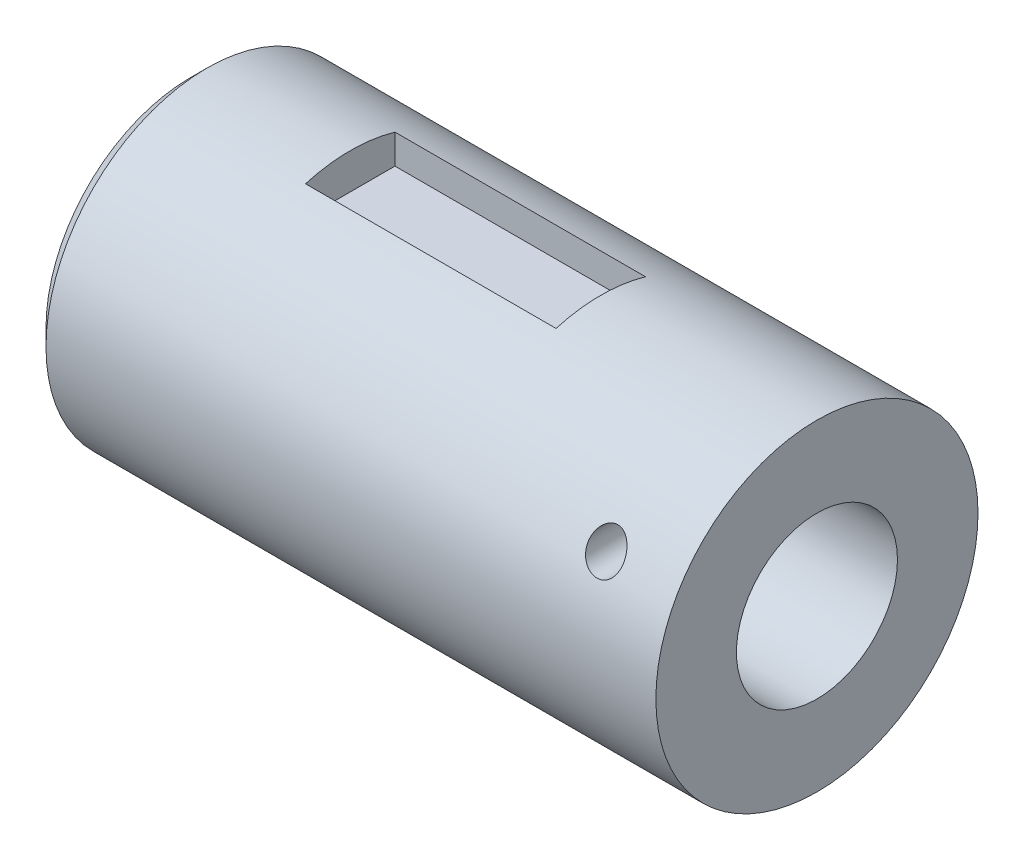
ISO-10303-21;
HEADER;
FILE_DESCRIPTION(('STEP AP214'),'2;1');
FILE_NAME('part.step','',(''),(''),'','','');
FILE_SCHEMA(('AUTOMOTIVE_DESIGN { 1 0 10303 214 1 1 1 1 }'));
ENDSEC;
DATA;
#1=APPLICATION_CONTEXT('core data for automotive mechanical design processes');
#2=APPLICATION_PROTOCOL_DEFINITION('international standard','automotive_design',2000,#1);
#3=PRODUCT_CONTEXT('',#1,'mechanical');
#4=PRODUCT('Part','Part','',(#3));
#5=PRODUCT_RELATED_PRODUCT_CATEGORY('part','',(#4));
#6=PRODUCT_DEFINITION_FORMATION('','',#4);
#7=PRODUCT_DEFINITION_CONTEXT('part definition',#1,'design');
#8=PRODUCT_DEFINITION('design','',#6,#7);
#9=PRODUCT_DEFINITION_SHAPE('','',#8);
#10=(LENGTH_UNIT() NAMED_UNIT(*) SI_UNIT(.MILLI.,.METRE.));
#11=(NAMED_UNIT(*) PLANE_ANGLE_UNIT() SI_UNIT($,.RADIAN.));
#12=(NAMED_UNIT(*) SI_UNIT($,.STERADIAN.) SOLID_ANGLE_UNIT());
#13=UNCERTAINTY_MEASURE_WITH_UNIT(LENGTH_MEASURE(1.E-05),#10,'distance_accuracy_value','');
#14=(GEOMETRIC_REPRESENTATION_CONTEXT(3) GLOBAL_UNCERTAINTY_ASSIGNED_CONTEXT((#13)) GLOBAL_UNIT_ASSIGNED_CONTEXT((#10,
#11,#12)) REPRESENTATION_CONTEXT('',''));
#15=CARTESIAN_POINT('',(0.,0.,0.));
#16=DIRECTION('',(0.,0.,1.));
#17=DIRECTION('',(1.,0.,0.));
#18=AXIS2_PLACEMENT_3D('',#15,#16,#17);
#19=CARTESIAN_POINT('',(38.6818850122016,0.,0.));
#20=DIRECTION('',(1.,0.,0.));
#21=DIRECTION('',(0.,0.,-1.));
#22=AXIS2_PLACEMENT_3D('',#19,#20,#21);
#23=CYLINDRICAL_SURFACE('',#22,18.);
#24=CARTESIAN_POINT('',(-41.5619397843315,0.,0.));
#25=DIRECTION('',(-1.,0.,0.));
#26=DIRECTION('',(0.,0.,1.));
#27=AXIS2_PLACEMENT_3D('',#24,#25,#26);
#28=CIRCLE('',#27,18.);
#29=CARTESIAN_POINT('',(-41.5619397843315,17.2916164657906,-5.));
#30=VERTEX_POINT('',#29);
#31=CARTESIAN_POINT('',(-41.5619397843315,17.2916164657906,5.));
#32=VERTEX_POINT('',#31);
#33=EDGE_CURVE('E161',#30,#32,#28,.F.);
#34=ORIENTED_EDGE('',*,*,#33,.F.);
#35=DIRECTION('',(1.,0.,0.));
#36=VECTOR('',#35,1.);
#37=CARTESIAN_POINT('',(38.6818850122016,17.2916164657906,-5.));
#38=LINE('',#37,#36);
#39=CARTESIAN_POINT('',(-13.5619397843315,17.2916164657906,-5.));
#40=VERTEX_POINT('',#39);
#41=EDGE_CURVE('E11',#40,#30,#38,.F.);
#42=ORIENTED_EDGE('',*,*,#41,.F.);
#43=CARTESIAN_POINT('',(-13.5619397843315,0.,0.));
#44=DIRECTION('',(1.,0.,0.));
#45=DIRECTION('',(0.,0.,-1.));
#46=AXIS2_PLACEMENT_3D('',#43,#44,#45);
#47=CIRCLE('',#46,18.);
#48=CARTESIAN_POINT('',(-13.5619397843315,17.2916164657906,5.));
#49=VERTEX_POINT('',#48);
#50=EDGE_CURVE('E52',#49,#40,#47,.F.);
#51=ORIENTED_EDGE('',*,*,#50,.F.);
#52=DIRECTION('',(1.,0.,0.));
#53=VECTOR('',#52,1.);
#54=CARTESIAN_POINT('',(38.6818850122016,17.2916164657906,5.));
#55=LINE('',#54,#53);
#56=EDGE_CURVE('E242',#32,#49,#55,.T.);
#57=ORIENTED_EDGE('',*,*,#56,.F.);
#58=EDGE_LOOP('',(#34,#42,#51,#57));
#59=FACE_BOUND('',#58,.T.);
#60=CARTESIAN_POINT('',(0.597924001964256,9.00000000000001,-15.5884572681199));
#61=CARTESIAN_POINT('',(0.597925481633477,8.87955349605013,-15.6579969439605));
#62=CARTESIAN_POINT('',(0.608807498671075,8.7582786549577,-15.7261381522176));
#63=CARTESIAN_POINT('',(0.653174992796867,8.51735808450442,-15.8579143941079));
#64=CARTESIAN_POINT('',(0.686658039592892,8.39771218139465,-15.921549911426));
#65=CARTESIAN_POINT('',(0.776949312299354,8.16340628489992,-16.0429515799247));
#66=CARTESIAN_POINT('',(0.833877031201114,8.04877521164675,-16.1006857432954));
#67=CARTESIAN_POINT('',(0.970769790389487,7.82996229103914,-16.2082247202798));
#68=CARTESIAN_POINT('',(1.05072141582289,7.72577440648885,-16.2580341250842));
#69=CARTESIAN_POINT('',(1.22279599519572,7.54289576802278,-16.3436194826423));
#70=CARTESIAN_POINT('',(1.31285237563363,7.46268928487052,-16.3803077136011));
#71=CARTESIAN_POINT('',(1.50796153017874,7.31873757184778,-16.4451308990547));
#72=CARTESIAN_POINT('',(1.61300313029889,7.25498017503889,-16.4732721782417));
#73=CARTESIAN_POINT('',(1.8231357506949,7.15286396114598,-16.517848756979));
#74=CARTESIAN_POINT('',(1.92708919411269,7.1125553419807,-16.5351961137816));
#75=CARTESIAN_POINT('',(2.14117882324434,7.04966360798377,-16.5621082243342));
#76=CARTESIAN_POINT('',(2.25131236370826,7.02707297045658,-16.5716762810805));
#77=CARTESIAN_POINT('',(2.46740447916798,7.00148005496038,-16.5825044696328));
#78=CARTESIAN_POINT('',(2.57321006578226,6.99737085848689,-16.5842341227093));
#79=CARTESIAN_POINT('',(2.78401487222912,7.00588578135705,-16.5806389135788));
#80=CARTESIAN_POINT('',(2.88901422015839,7.01850718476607,-16.5753151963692));
#81=CARTESIAN_POINT('',(3.09341897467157,7.05959446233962,-16.557856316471));
#82=CARTESIAN_POINT('',(3.19288856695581,7.08779182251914,-16.5458365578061));
#83=CARTESIAN_POINT('',(3.38542859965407,7.15870594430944,-16.5152780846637));
#84=CARTESIAN_POINT('',(3.47849878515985,7.20142328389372,-16.4967391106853));
#85=CARTESIAN_POINT('',(3.65793380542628,7.30084365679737,-16.4529840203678));
#86=CARTESIAN_POINT('',(3.74410380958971,7.35783623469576,-16.4276287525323));
#87=CARTESIAN_POINT('',(3.90548216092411,7.48318133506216,-16.3709108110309));
#88=CARTESIAN_POINT('',(3.98068830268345,7.55153613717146,-16.3395469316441));
#89=CARTESIAN_POINT('',(4.12288936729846,7.70162147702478,-16.2693660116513));
#90=CARTESIAN_POINT('',(4.18913779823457,7.78390331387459,-16.230218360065));
#91=CARTESIAN_POINT('',(4.3069460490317,7.9559101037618,-16.146598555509));
#92=CARTESIAN_POINT('',(4.35850084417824,8.04563758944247,-16.1021245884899));
#93=CARTESIAN_POINT('',(4.45063676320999,8.23848757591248,-16.0043756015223));
#94=CARTESIAN_POINT('',(4.48976724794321,8.34208224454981,-15.95066717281));
#95=CARTESIAN_POINT('',(4.55020069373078,8.55214114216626,-15.8390358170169));
#96=CARTESIAN_POINT('',(4.57149562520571,8.65860664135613,-15.781111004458));
#97=CARTESIAN_POINT('',(4.59810640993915,8.88376767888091,-15.6555758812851));
#98=CARTESIAN_POINT('',(4.60137812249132,9.00250452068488,-15.5876054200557));
#99=CARTESIAN_POINT('',(4.58726459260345,9.23747549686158,-15.4495195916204));
#100=CARTESIAN_POINT('',(4.56987031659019,9.3537085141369,-15.3794032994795));
#101=CARTESIAN_POINT('',(4.51262185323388,9.59186974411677,-15.232117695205));
#102=CARTESIAN_POINT('',(4.47080860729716,9.71330498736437,-15.1549054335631));
#103=CARTESIAN_POINT('',(4.36411002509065,9.9471663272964,-15.0024463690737));
#104=CARTESIAN_POINT('',(4.29920126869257,10.0595831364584,-14.9272016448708));
#105=CARTESIAN_POINT('',(4.14598893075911,10.2731787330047,-14.7810261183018));
#106=CARTESIAN_POINT('',(4.05742215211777,10.3742116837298,-14.7101556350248));
#107=CARTESIAN_POINT('',(3.85799313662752,10.5590380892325,-14.5780511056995));
#108=CARTESIAN_POINT('',(3.74718990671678,10.6428760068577,-14.5167923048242));
#109=CARTESIAN_POINT('',(3.54563729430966,10.7637159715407,-14.427268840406));
#110=CARTESIAN_POINT('',(3.46049776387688,10.8070175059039,-14.3948101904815));
#111=CARTESIAN_POINT('',(3.28247078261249,10.8816703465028,-14.3384600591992));
#112=CARTESIAN_POINT('',(3.18959054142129,10.9130326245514,-14.3145607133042));
#113=CARTESIAN_POINT('',(2.9975978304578,10.962176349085,-14.2769630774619));
#114=CARTESIAN_POINT('',(2.89844894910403,10.9798686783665,-14.2633317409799));
#115=CARTESIAN_POINT('',(2.69770861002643,11.0000499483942,-14.2477744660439));
#116=CARTESIAN_POINT('',(2.59611830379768,11.0025459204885,-14.2458431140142));
#117=CARTESIAN_POINT('',(2.40475962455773,10.9927128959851,-14.2534304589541));
#118=CARTESIAN_POINT('',(2.31485997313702,10.9818977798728,-14.2617799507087));
#119=CARTESIAN_POINT('',(2.13857629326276,10.9486015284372,-14.2873566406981));
#120=CARTESIAN_POINT('',(2.05219265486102,10.9261191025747,-14.3045848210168));
#121=CARTESIAN_POINT('',(1.88339584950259,10.8701618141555,-14.3471540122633));
#122=CARTESIAN_POINT('',(1.80108280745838,10.8364954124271,-14.3726361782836));
#123=CARTESIAN_POINT('',(1.64347828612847,10.7597518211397,-14.4301780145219));
#124=CARTESIAN_POINT('',(1.56818950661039,10.7166710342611,-14.462240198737));
#125=CARTESIAN_POINT('',(1.41473349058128,10.6154644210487,-14.5367265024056));
#126=CARTESIAN_POINT('',(1.33782275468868,10.556051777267,-14.5799832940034));
#127=CARTESIAN_POINT('',(1.19492777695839,10.4285607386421,-14.6714446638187));
#128=CARTESIAN_POINT('',(1.12895062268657,10.3604767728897,-14.7196524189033));
#129=CARTESIAN_POINT('',(0.996340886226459,10.2031184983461,-14.8292703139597));
#130=CARTESIAN_POINT('',(0.932130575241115,10.1123099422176,-14.8914125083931));
#131=CARTESIAN_POINT('',(0.820112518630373,9.92277856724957,-15.0183723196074));
#132=CARTESIAN_POINT('',(0.772315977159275,9.8240503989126,-15.0831917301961));
#133=CARTESIAN_POINT('',(0.6885060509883,9.60765237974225,-15.2220744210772));
#134=CARTESIAN_POINT('',(0.654773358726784,9.4891727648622,-15.296262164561));
#135=CARTESIAN_POINT('',(0.609481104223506,9.24742225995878,-15.4436143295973));
#136=CARTESIAN_POINT('',(0.59792247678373,9.12415116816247,-15.5167787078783));
#137=CARTESIAN_POINT('',(0.597924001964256,9.00000000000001,-15.5884572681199));
#138=B_SPLINE_CURVE_WITH_KNOTS('',3,(#60,#61,#62,#63,#64,#65,#66,#67,#68,#69,#70,#71,#72,#73,
#74,#75,#76,#77,#78,#79,#80,#81,#82,#83,#84,#85,#86,#87,#88,#89,#90,#91,#92,#93,#94,#95,#96,#97,
#98,#99,#100,#101,#102,#103,#104,#105,#106,#107,#108,#109,#110,#111,#112,#113,#114,#115,#116,
#117,#118,#119,#120,#121,#122,#123,#124,#125,#126,#127,#128,#129,#130,#131,#132,#133,#134,#135,
#136,#137),.UNSPECIFIED.,.T.,.F.,(4,2,2,2,2,2,2,2,2,2,2,2,2,2,2,2,2,2,2,2,2,2,2,2,2,2,2,2,2,2,2,
2,2,2,2,2,2,2,4),(0.,0.416791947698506,0.833539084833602,1.25243711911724,1.67109157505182,
2.04714210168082,2.42291367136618,2.75966841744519,3.09628010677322,3.41243668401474,
3.72854194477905,4.03936064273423,4.35019171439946,4.66792619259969,4.98572449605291,
5.32227731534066,5.65894508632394,6.02666361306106,6.39454759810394,6.80341034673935,
7.21245188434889,7.65997578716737,8.10795480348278,8.56114165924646,9.01314146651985,
9.31461756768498,9.61581594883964,9.91896171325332,10.2219672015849,10.4934796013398,
10.7650220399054,11.0414778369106,11.3180394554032,11.6360048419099,11.9541755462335,
12.3349112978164,12.71590642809,13.1454998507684,13.5751113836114),.UNSPECIFIED.);
#139=CARTESIAN_POINT('',(0.597924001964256,9.00000000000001,-15.5884572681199));
#140=VERTEX_POINT('',#139);
#141=EDGE_CURVE('E122',#140,#140,#138,.T.);
#142=ORIENTED_EDGE('',*,*,#141,.T.);
#143=EDGE_LOOP('',(#142));
#144=FACE_BOUND('',#143,.T.);
#145=CARTESIAN_POINT('',(-57.5619397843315,0.,0.));
#146=DIRECTION('',(1.,0.,0.));
#147=DIRECTION('',(0.,0.,-1.));
#148=AXIS2_PLACEMENT_3D('',#145,#146,#147);
#149=CIRCLE('',#148,18.);
#150=CARTESIAN_POINT('',(-57.5619397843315,0.,-18.));
#151=VERTEX_POINT('',#150);
#152=EDGE_CURVE('E193',#151,#151,#149,.T.);
#153=ORIENTED_EDGE('',*,*,#152,.T.);
#154=EDGE_LOOP('',(#153));
#155=FACE_BOUND('',#154,.T.);
#156=CARTESIAN_POINT('',(10.5979240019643,0.,0.));
#157=DIRECTION('',(1.,0.,0.));
#158=DIRECTION('',(0.,0.,-1.));
#159=AXIS2_PLACEMENT_3D('',#156,#157,#158);
#160=CIRCLE('',#159,18.);
#161=CARTESIAN_POINT('',(10.5979240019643,0.,-18.));
#162=VERTEX_POINT('',#161);
#163=EDGE_CURVE('E196',#162,#162,#160,.T.);
#164=ORIENTED_EDGE('',*,*,#163,.F.);
#165=EDGE_LOOP('',(#164));
#166=FACE_BOUND('',#165,.T.);
#167=CARTESIAN_POINT('',(0.597924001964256,9.00000000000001,15.5884572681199));
#168=CARTESIAN_POINT('',(0.597927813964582,9.14766556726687,15.5031975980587));
#169=CARTESIAN_POINT('',(0.614289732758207,9.29421282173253,15.415759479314));
#170=CARTESIAN_POINT('',(0.678243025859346,9.57993263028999,15.2398539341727));
#171=CARTESIAN_POINT('',(0.725887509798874,9.71909220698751,15.1513850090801));
#172=CARTESIAN_POINT('',(0.844383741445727,9.97071436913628,14.9868266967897));
#173=CARTESIAN_POINT('',(0.912153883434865,10.0844350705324,14.9104361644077));
#174=CARTESIAN_POINT('',(1.07094302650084,10.2984687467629,14.7634114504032));
#175=CARTESIAN_POINT('',(1.16191511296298,10.3988081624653,14.6927660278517));
#176=CARTESIAN_POINT('',(1.33966190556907,10.5579077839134,14.5786683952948));
#177=CARTESIAN_POINT('',(1.4213756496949,10.6206950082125,14.5329221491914));
#178=CARTESIAN_POINT('',(1.59634793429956,10.7342675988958,14.4492373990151));
#179=CARTESIAN_POINT('',(1.68959164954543,10.7850681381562,14.411289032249));
#180=CARTESIAN_POINT('',(1.87122512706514,10.8655391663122,14.3506869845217));
#181=CARTESIAN_POINT('',(1.95822954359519,10.8972400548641,14.3265903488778));
#182=CARTESIAN_POINT('',(2.13768885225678,10.9485569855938,14.2874123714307));
#183=CARTESIAN_POINT('',(2.23014065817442,10.968179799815,14.2723259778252));
#184=CARTESIAN_POINT('',(2.41837010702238,10.9941960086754,14.252295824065));
#185=CARTESIAN_POINT('',(2.51415934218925,11.0005373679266,14.2473919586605));
#186=CARTESIAN_POINT('',(2.70560300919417,10.9993911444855,14.2482769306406));
#187=CARTESIAN_POINT('',(2.80125745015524,10.9919045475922,14.2540650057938));
#188=CARTESIAN_POINT('',(2.98318942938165,10.9645570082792,14.2751095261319));
#189=CARTESIAN_POINT('',(3.06967170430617,10.9455347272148,14.2897240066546));
#190=CARTESIAN_POINT('',(3.23779808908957,10.896899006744,14.326846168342));
#191=CARTESIAN_POINT('',(3.31944114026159,10.8672832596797,14.3493555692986));
#192=CARTESIAN_POINT('',(3.48217742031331,10.7962588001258,14.4028783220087));
#193=CARTESIAN_POINT('',(3.5627962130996,10.7541474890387,14.4343921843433));
#194=CARTESIAN_POINT('',(3.71576345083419,10.6608652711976,14.5034243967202));
#195=CARTESIAN_POINT('',(3.78810775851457,10.6096898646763,14.5409457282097));
#196=CARTESIAN_POINT('',(3.93594654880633,10.4900535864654,14.6275469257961));
#197=CARTESIAN_POINT('',(4.00974920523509,10.4201358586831,14.6774984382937));
#198=CARTESIAN_POINT('',(4.14471000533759,10.2718187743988,14.7816769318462));
#199=CARTESIAN_POINT('',(4.20585962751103,10.1934137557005,14.8359067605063));
#200=CARTESIAN_POINT('',(4.32575633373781,10.0140749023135,14.9576789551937));
#201=CARTESIAN_POINT('',(4.38179516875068,9.91170373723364,15.0257803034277));
#202=CARTESIAN_POINT('',(4.47512518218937,9.69967743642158,15.1635179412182));
#203=CARTESIAN_POINT('',(4.51240424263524,9.59001764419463,15.2331551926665));
#204=CARTESIAN_POINT('',(4.57085086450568,9.35245185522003,15.3802908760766));
#205=CARTESIAN_POINT('',(4.58960465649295,9.22391773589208,15.4577495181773));
#206=CARTESIAN_POINT('',(4.60182781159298,8.96397795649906,15.6099258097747));
#207=CARTESIAN_POINT('',(4.59529235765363,8.83257175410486,15.6846429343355));
#208=CARTESIAN_POINT('',(4.55595768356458,8.57178104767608,15.82866385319));
#209=CARTESIAN_POINT('',(4.52333246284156,8.44238892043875,15.8980001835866));
#210=CARTESIAN_POINT('',(4.43132520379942,8.18963813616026,16.0296629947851));
#211=CARTESIAN_POINT('',(4.3719615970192,8.06627538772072,16.0919942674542));
#212=CARTESIAN_POINT('',(4.23412591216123,7.84316086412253,16.2018131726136));
#213=CARTESIAN_POINT('',(4.15817147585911,7.74228209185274,16.2501628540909));
#214=CARTESIAN_POINT('',(3.98625021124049,7.55477260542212,16.3381804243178));
#215=CARTESIAN_POINT('',(3.89030140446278,7.46812918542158,16.3778560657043));
#216=CARTESIAN_POINT('',(3.69366773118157,7.32295938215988,16.4432315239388));
#217=CARTESIAN_POINT('',(3.59491142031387,7.2623123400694,16.4700336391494));
#218=CARTESIAN_POINT('',(3.3868691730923,7.15851948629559,16.5154117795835));
#219=CARTESIAN_POINT('',(3.277589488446,7.11536336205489,16.5339926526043));
#220=CARTESIAN_POINT('',(3.06173195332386,7.0515483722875,16.5613033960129));
#221=CARTESIAN_POINT('',(2.95571324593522,7.02928975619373,16.5707360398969));
#222=CARTESIAN_POINT('',(2.74108741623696,7.00220341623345,16.5822004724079));
#223=CARTESIAN_POINT('',(2.63248105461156,6.99737063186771,16.5842344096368));
#224=CARTESIAN_POINT('',(2.42024852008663,7.00518841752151,16.5809331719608));
#225=CARTESIAN_POINT('',(2.31659237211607,7.01716912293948,16.5758803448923));
#226=CARTESIAN_POINT('',(2.11293782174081,7.05692244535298,16.5589947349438));
#227=CARTESIAN_POINT('',(2.01293921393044,7.08469417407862,16.5471623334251));
#228=CARTESIAN_POINT('',(1.81906004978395,7.15499776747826,16.5168842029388));
#229=CARTESIAN_POINT('',(1.72519587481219,7.19756737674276,16.4984215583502));
#230=CARTESIAN_POINT('',(1.54619300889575,7.29580217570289,16.455216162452));
#231=CARTESIAN_POINT('',(1.46105524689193,7.3514687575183,16.4304727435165));
#232=CARTESIAN_POINT('',(1.29812611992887,7.4763597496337,16.3740316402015));
#233=CARTESIAN_POINT('',(1.2207672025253,7.54603892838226,16.3420945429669));
#234=CARTESIAN_POINT('',(1.07889904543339,7.69495196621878,16.2725064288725));
#235=CARTESIAN_POINT('',(1.01439442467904,7.77418924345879,16.2348533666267));
#236=CARTESIAN_POINT('',(0.894698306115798,7.94605231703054,16.1514717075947));
#237=CARTESIAN_POINT('',(0.840589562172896,8.03923813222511,16.1053465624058));
#238=CARTESIAN_POINT('',(0.748659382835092,8.2308938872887,16.0082456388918));
#239=CARTESIAN_POINT('',(0.710837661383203,8.32936373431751,15.9572699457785));
#240=CARTESIAN_POINT('',(0.653143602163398,8.52310185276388,15.8545902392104));
#241=CARTESIAN_POINT('',(0.632340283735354,8.61821397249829,15.8031084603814));
#242=CARTESIAN_POINT('',(0.604724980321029,8.80903893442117,15.6975400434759));
#243=CARTESIAN_POINT('',(0.597921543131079,8.90475210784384,15.6434518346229));
#244=CARTESIAN_POINT('',(0.597924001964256,9.00000000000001,15.5884572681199));
#245=B_SPLINE_CURVE_WITH_KNOTS('',3,(#167,#168,#169,#170,#171,#172,#173,#174,#175,#176,#177,
#178,#179,#180,#181,#182,#183,#184,#185,#186,#187,#188,#189,#190,#191,#192,#193,#194,#195,#196,
#197,#198,#199,#200,#201,#202,#203,#204,#205,#206,#207,#208,#209,#210,#211,#212,#213,#214,#215,
#216,#217,#218,#219,#220,#221,#222,#223,#224,#225,#226,#227,#228,#229,#230,#231,#232,#233,#234,
#235,#236,#237,#238,#239,#240,#241,#242,#243,#244),.UNSPECIFIED.,.T.,.F.,(4,2,2,2,2,2,2,2,2,2,2,
2,2,2,2,2,2,2,2,2,2,2,2,2,2,2,2,2,2,2,2,2,2,2,2,2,2,2,4),(0.,0.511038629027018,1.02294711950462,
1.47927181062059,1.93468102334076,2.27165671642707,2.60820354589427,2.89404397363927,
3.17972398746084,3.46652118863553,3.7532979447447,4.02137625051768,4.28951298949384,
4.57720700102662,4.86504423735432,5.20360939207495,5.54240182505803,5.946147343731,
6.35015333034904,6.80172719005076,7.25338706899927,7.7020595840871,8.15042328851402,
8.55376034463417,8.95673542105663,9.31166542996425,9.6663858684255,9.99097175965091,
10.3154633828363,10.6273877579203,10.9392945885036,11.2520029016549,11.5647444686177,
11.8900480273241,12.2154682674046,12.5656609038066,12.9158473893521,13.2452786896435,
13.5749110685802),.UNSPECIFIED.);
#246=CARTESIAN_POINT('',(0.597924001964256,9.00000000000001,15.5884572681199));
#247=VERTEX_POINT('',#246);
#248=EDGE_CURVE('E131',#247,#247,#245,.T.);
#249=ORIENTED_EDGE('',*,*,#248,.T.);
#250=EDGE_LOOP('',(#249));
#251=FACE_BOUND('',#250,.T.);
#252=ADVANCED_FACE('F43',(#59,#144,#155,#166,#251),#23,.T.);
#253=CARTESIAN_POINT('',(38.6818850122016,0.,0.));
#254=DIRECTION('',(1.,0.,0.));
#255=DIRECTION('',(0.,0.,-1.));
#256=AXIS2_PLACEMENT_3D('',#253,#254,#255);
#257=CYLINDRICAL_SURFACE('',#256,9.);
#258=CARTESIAN_POINT('',(-3.40207599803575,0.,0.));
#259=DIRECTION('',(1.,0.,0.));
#260=DIRECTION('',(0.,0.,-1.));
#261=AXIS2_PLACEMENT_3D('',#258,#259,#260);
#262=CIRCLE('',#261,9.);
#263=CARTESIAN_POINT('',(-3.40207599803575,0.,-9.));
#264=VERTEX_POINT('',#263);
#265=EDGE_CURVE('E222',#264,#264,#262,.T.);
#266=ORIENTED_EDGE('',*,*,#265,.F.);
#267=EDGE_LOOP('',(#266));
#268=FACE_BOUND('',#267,.T.);
#269=CARTESIAN_POINT('',(10.5979240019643,0.,0.));
#270=DIRECTION('',(1.,0.,0.));
#271=DIRECTION('',(0.,0.,-1.));
#272=AXIS2_PLACEMENT_3D('',#269,#270,#271);
#273=CIRCLE('',#272,9.00000000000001);
#274=CARTESIAN_POINT('',(10.5979240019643,0.,-9.00000000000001));
#275=VERTEX_POINT('',#274);
#276=EDGE_CURVE('E226',#275,#275,#273,.T.);
#277=ORIENTED_EDGE('',*,*,#276,.T.);
#278=EDGE_LOOP('',(#277));
#279=FACE_BOUND('',#278,.T.);
#280=CARTESIAN_POINT('',(0.597924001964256,9.00000000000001,0.));
#281=CARTESIAN_POINT('',(0.597928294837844,9.00000061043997,0.125752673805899));
#282=CARTESIAN_POINT('',(0.597919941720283,8.99736445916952,0.251492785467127));
#283=CARTESIAN_POINT('',(0.597959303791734,8.98682633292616,0.502749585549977));
#284=CARTESIAN_POINT('',(0.598007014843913,8.9789247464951,0.628266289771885));
#285=CARTESIAN_POINT('',(0.598340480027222,8.95786388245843,0.878921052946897));
#286=CARTESIAN_POINT('',(0.59862635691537,8.94470189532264,1.00405888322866));
#287=CARTESIAN_POINT('',(0.599748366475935,8.9131454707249,1.2536584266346));
#288=CARTESIAN_POINT('',(0.600584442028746,8.89475157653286,1.37812020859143));
#289=CARTESIAN_POINT('',(0.603236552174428,8.85281950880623,1.62583063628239));
#290=CARTESIAN_POINT('',(0.605050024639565,8.82929488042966,1.74908159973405));
#291=CARTESIAN_POINT('',(0.610208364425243,8.77712372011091,1.99444936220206));
#292=CARTESIAN_POINT('',(0.613553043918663,8.74847781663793,2.11656629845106));
#293=CARTESIAN_POINT('',(0.622452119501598,8.6861509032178,2.35933823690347));
#294=CARTESIAN_POINT('',(0.628004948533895,8.65247347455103,2.479994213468));
#295=CARTESIAN_POINT('',(0.642137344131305,8.58017089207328,2.71961809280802));
#296=CARTESIAN_POINT('',(0.650716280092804,8.54154677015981,2.83858634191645));
#297=CARTESIAN_POINT('',(0.669813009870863,8.46750712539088,3.05146282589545));
#298=CARTESIAN_POINT('',(0.679625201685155,8.4329375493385,3.14572869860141));
#299=CARTESIAN_POINT('',(0.702439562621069,8.36080484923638,3.33271372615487));
#300=CARTESIAN_POINT('',(0.715441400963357,8.32324203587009,3.42543304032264));
#301=CARTESIAN_POINT('',(0.745345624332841,8.24521352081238,3.60921552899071));
#302=CARTESIAN_POINT('',(0.762255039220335,8.20474267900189,3.70027539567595));
#303=CARTESIAN_POINT('',(0.800752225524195,8.12119992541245,3.8801993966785));
#304=CARTESIAN_POINT('',(0.822339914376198,8.07812805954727,3.9690635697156));
#305=CARTESIAN_POINT('',(0.87143443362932,7.98913279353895,4.14531443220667));
#306=CARTESIAN_POINT('',(0.899017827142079,7.94317856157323,4.23266455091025));
#307=CARTESIAN_POINT('',(0.961016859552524,7.84948152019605,4.40399496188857));
#308=CARTESIAN_POINT('',(0.995434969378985,7.80173806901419,4.48797402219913));
#309=CARTESIAN_POINT('',(1.07214345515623,7.70548646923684,4.65128127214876));
#310=CARTESIAN_POINT('',(1.11439907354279,7.65698253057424,4.73062803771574));
#311=CARTESIAN_POINT('',(1.20811383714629,7.5602229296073,4.88377043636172));
#312=CARTESIAN_POINT('',(1.25956157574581,7.51196703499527,4.95757279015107));
#313=CARTESIAN_POINT('',(1.37037998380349,7.41946073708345,5.09491344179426));
#314=CARTESIAN_POINT('',(1.42928726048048,7.37512787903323,5.15876494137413));
#315=CARTESIAN_POINT('',(1.55752611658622,7.29018082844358,5.27812734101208));
#316=CARTESIAN_POINT('',(1.6268594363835,7.24956725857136,5.33363684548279));
#317=CARTESIAN_POINT('',(1.77702900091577,7.17427814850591,5.43449597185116));
#318=CARTESIAN_POINT('',(1.85799187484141,7.13967871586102,5.47971733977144));
#319=CARTESIAN_POINT('',(2.02958784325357,7.08031675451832,5.5562116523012));
#320=CARTESIAN_POINT('',(2.12020468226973,7.05553801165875,5.58750759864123));
#321=CARTESIAN_POINT('',(2.29538115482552,7.02128028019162,5.63047795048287));
#322=CARTESIAN_POINT('',(2.37911188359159,7.0101896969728,5.64422793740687));
#323=CARTESIAN_POINT('',(2.54840697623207,6.99882051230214,5.65832190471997));
#324=CARTESIAN_POINT('',(2.63396973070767,6.99853278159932,5.65867720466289));
#325=CARTESIAN_POINT('',(2.79012789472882,7.00796389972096,5.64698771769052));
#326=CARTESIAN_POINT('',(2.86097625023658,7.01612897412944,5.6368683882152));
#327=CARTESIAN_POINT('',(2.99957279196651,7.03948608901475,5.60767185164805));
#328=CARTESIAN_POINT('',(3.06732110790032,7.05467783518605,5.58859501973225));
#329=CARTESIAN_POINT('',(3.20023060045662,7.09156353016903,5.54171743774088));
#330=CARTESIAN_POINT('',(3.26525477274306,7.11343753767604,5.51367394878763));
#331=CARTESIAN_POINT('',(3.38958730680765,7.16213817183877,5.45026412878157));
#332=CARTESIAN_POINT('',(3.44889290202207,7.18896717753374,5.41489427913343));
#333=CARTESIAN_POINT('',(3.59168225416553,7.26164802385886,5.31731669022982));
#334=CARTESIAN_POINT('',(3.67103390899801,7.30997503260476,5.25090049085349));
#335=CARTESIAN_POINT('',(3.81582557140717,7.41111255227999,5.10716788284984));
#336=CARTESIAN_POINT('',(3.88123031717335,7.46393396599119,5.02982464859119));
#337=CARTESIAN_POINT('',(3.9861780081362,7.55897136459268,4.88545544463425));
#338=CARTESIAN_POINT('',(4.02822908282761,7.60090074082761,4.82002125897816));
#339=CARTESIAN_POINT('',(4.10565927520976,7.68470818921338,4.68524883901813));
#340=CARTESIAN_POINT('',(4.14103452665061,7.7265862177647,4.6159083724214));
#341=CARTESIAN_POINT('',(4.20594642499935,7.80960349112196,4.47402063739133));
#342=CARTESIAN_POINT('',(4.23547584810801,7.85074176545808,4.40146953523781));
#343=CARTESIAN_POINT('',(4.28942516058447,7.93173572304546,4.25378345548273));
#344=CARTESIAN_POINT('',(4.31384312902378,7.97159091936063,4.17864751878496));
#345=CARTESIAN_POINT('',(4.37602192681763,8.0808075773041,3.96537698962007));
#346=CARTESIAN_POINT('',(4.40886580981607,8.14831500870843,3.82484985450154));
#347=CARTESIAN_POINT('',(4.46381934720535,8.27660768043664,3.53870327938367));
#348=CARTESIAN_POINT('',(4.48592042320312,8.33738751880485,3.39307986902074));
#349=CARTESIAN_POINT('',(4.52220444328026,8.45160252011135,3.09766843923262));
#350=CARTESIAN_POINT('',(4.5363694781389,8.50502086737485,2.94787179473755));
#351=CARTESIAN_POINT('',(4.55897066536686,8.60393420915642,2.64530763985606));
#352=CARTESIAN_POINT('',(4.56740762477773,8.64943031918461,2.49254055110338));
#353=CARTESIAN_POINT('',(4.57893220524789,8.72311173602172,2.2187249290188));
#354=CARTESIAN_POINT('',(4.58279026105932,8.7529001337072,2.09813454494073));
#355=CARTESIAN_POINT('',(4.58882509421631,8.80747051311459,1.85577273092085));
#356=CARTESIAN_POINT('',(4.59100171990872,8.83225204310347,1.7340011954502));
#357=CARTESIAN_POINT('',(4.59424808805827,8.87676127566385,1.48948252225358));
#358=CARTESIAN_POINT('',(4.59531745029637,8.89648724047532,1.36673506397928));
#359=CARTESIAN_POINT('',(4.59680182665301,8.93083991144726,1.12051374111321));
#360=CARTESIAN_POINT('',(4.59721678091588,8.94546615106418,0.997039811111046));
#361=CARTESIAN_POINT('',(4.5977295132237,8.96960525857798,0.749447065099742));
#362=CARTESIAN_POINT('',(4.59782692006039,8.97911213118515,0.625327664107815));
#363=CARTESIAN_POINT('',(4.59792365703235,8.99297003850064,0.376801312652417));
#364=CARTESIAN_POINT('',(4.5979229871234,8.99732107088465,0.252394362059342));
#365=CARTESIAN_POINT('',(4.59792460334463,9.00085942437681,0.00353308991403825));
#366=CARTESIAN_POINT('',(4.59792688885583,9.0000478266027,-0.120921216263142));
#367=CARTESIAN_POINT('',(4.59791552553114,8.99326514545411,-0.369678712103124));
#368=CARTESIAN_POINT('',(4.59790187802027,8.98729449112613,-0.493981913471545));
#369=CARTESIAN_POINT('',(4.59771939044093,8.97011628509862,-0.743515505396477));
#370=CARTESIAN_POINT('',(4.59754894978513,8.95885530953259,-0.868742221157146));
#371=CARTESIAN_POINT('',(4.59678501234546,8.931099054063,-1.1186009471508));
#372=CARTESIAN_POINT('',(4.59619155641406,8.91460427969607,-1.24323301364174));
#373=CARTESIAN_POINT('',(4.59419261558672,8.87639619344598,-1.49178109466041));
#374=CARTESIAN_POINT('',(4.59278654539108,8.85467912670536,-1.61569652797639));
#375=CARTESIAN_POINT('',(4.58864974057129,8.8060775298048,-1.86247458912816));
#376=CARTESIAN_POINT('',(4.58591916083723,8.77919360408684,-1.98533733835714));
#377=CARTESIAN_POINT('',(4.57851084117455,8.72044958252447,-2.22921942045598));
#378=CARTESIAN_POINT('',(4.57384201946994,8.68861269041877,-2.35024459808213));
#379=CARTESIAN_POINT('',(4.56179455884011,8.61996414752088,-2.59072371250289));
#380=CARTESIAN_POINT('',(4.55441638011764,8.58315334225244,-2.71017791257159));
#381=CARTESIAN_POINT('',(4.53604798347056,8.50472637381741,-2.9470623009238));
#382=CARTESIAN_POINT('',(4.52506216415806,8.46311610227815,-3.06449477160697));
#383=CARTESIAN_POINT('',(4.49839892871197,8.37525657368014,-3.29704636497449));
#384=CARTESIAN_POINT('',(4.48272314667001,8.32900893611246,-3.412166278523));
#385=CARTESIAN_POINT('',(4.45269227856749,8.25111403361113,-3.59510531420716));
#386=CARTESIAN_POINT('',(4.44021820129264,8.2208301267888,-3.66381599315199));
#387=CARTESIAN_POINT('',(4.41271581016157,8.15876192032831,-3.80002781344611));
#388=CARTESIAN_POINT('',(4.39768767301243,8.12697772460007,-3.86752903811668));
#389=CARTESIAN_POINT('',(4.34820155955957,8.02950492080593,-4.06805814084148));
#390=CARTESIAN_POINT('',(4.30935050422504,7.9617201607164,-4.19905509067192));
#391=CARTESIAN_POINT('',(4.21617349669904,7.8216927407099,-4.45449206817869));
#392=CARTESIAN_POINT('',(4.16173015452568,7.7494196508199,-4.57887353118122));
#393=CARTESIAN_POINT('',(4.03330139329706,7.60390354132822,-4.81662898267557));
#394=CARTESIAN_POINT('',(3.95935209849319,7.53066254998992,-4.9300227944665));
#395=CARTESIAN_POINT('',(3.81794215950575,7.41357358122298,-5.10350679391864));
#396=CARTESIAN_POINT('',(3.75735465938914,7.36845145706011,-5.16831309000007));
#397=CARTESIAN_POINT('',(3.62534028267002,7.28226496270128,-5.28905313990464));
#398=CARTESIAN_POINT('',(3.55392583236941,7.24119602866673,-5.34499691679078));
#399=CARTESIAN_POINT('',(3.41249392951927,7.17198565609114,-5.43740941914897));
#400=CARTESIAN_POINT('',(3.34408730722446,7.14282724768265,-5.47556243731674));
#401=CARTESIAN_POINT('',(3.20024222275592,7.09132655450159,-5.54209909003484));
#402=CARTESIAN_POINT('',(3.12480688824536,7.06898125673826,-5.57048704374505));
#403=CARTESIAN_POINT('',(2.96789826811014,7.03285924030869,-5.61602693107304));
#404=CARTESIAN_POINT('',(2.886381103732,7.01915324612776,-5.63308618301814));
#405=CARTESIAN_POINT('',(2.72063499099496,7.00203526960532,-5.65435252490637));
#406=CARTESIAN_POINT('',(2.63640811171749,6.99861561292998,-5.65856919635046));
#407=CARTESIAN_POINT('',(2.4800229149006,7.00215730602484,-5.65418300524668));
#408=CARTESIAN_POINT('',(2.40777830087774,7.00777256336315,-5.64724255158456));
#409=CARTESIAN_POINT('',(2.26583599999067,7.02646496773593,-5.62396754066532));
#410=CARTESIAN_POINT('',(2.19613823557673,7.03954188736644,-5.60763326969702));
#411=CARTESIAN_POINT('',(2.0607601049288,7.07222283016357,-5.56635869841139));
#412=CARTESIAN_POINT('',(1.99509235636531,7.09184622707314,-5.54139284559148));
#413=CARTESIAN_POINT('',(1.86905929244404,7.13633924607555,-5.48397509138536));
#414=CARTESIAN_POINT('',(1.80869622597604,7.1612110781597,-5.45152003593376));
#415=CARTESIAN_POINT('',(1.66579498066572,7.22798815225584,-5.3628867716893));
#416=CARTESIAN_POINT('',(1.58676742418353,7.27229108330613,-5.30285135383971));
#417=CARTESIAN_POINT('',(1.44155535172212,7.36588878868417,-5.17205628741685));
#418=CARTESIAN_POINT('',(1.37540125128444,7.41519497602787,-5.10127192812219));
#419=CARTESIAN_POINT('',(1.26949557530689,7.50373203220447,-4.96977936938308));
#420=CARTESIAN_POINT('',(1.22722435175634,7.54252464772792,-4.91075869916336));
#421=CARTESIAN_POINT('',(1.1488225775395,7.62044840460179,-4.78894481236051));
#422=CARTESIAN_POINT('',(1.11269535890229,7.65957971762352,-4.72614957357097));
#423=CARTESIAN_POINT('',(1.04589663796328,7.73752267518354,-4.59743546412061));
#424=CARTESIAN_POINT('',(1.01523186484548,7.77633387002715,-4.53151286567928));
#425=CARTESIAN_POINT('',(0.958747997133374,7.85310381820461,-4.397130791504));
#426=CARTESIAN_POINT('',(0.932930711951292,7.89106224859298,-4.32867037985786));
#427=CARTESIAN_POINT('',(0.867316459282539,7.99444804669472,-4.13621027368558));
#428=CARTESIAN_POINT('',(0.832024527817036,8.05856621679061,-4.00996263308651));
#429=CARTESIAN_POINT('',(0.771746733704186,8.18160860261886,-3.75255769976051));
#430=CARTESIAN_POINT('',(0.746768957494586,8.24052871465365,-3.6213966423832));
#431=CARTESIAN_POINT('',(0.704690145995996,8.35250583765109,-3.35507842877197));
#432=CARTESIAN_POINT('',(0.687604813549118,8.40555100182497,-3.21991387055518));
#433=CARTESIAN_POINT('',(0.659403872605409,8.50521261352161,-2.94661464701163));
#434=CARTESIAN_POINT('',(0.648290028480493,8.55182715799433,-2.80847911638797));
#435=CARTESIAN_POINT('',(0.625518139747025,8.66191308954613,-2.45397603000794));
#436=CARTESIAN_POINT('',(0.616858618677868,8.72074330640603,-2.23596437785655));
#437=CARTESIAN_POINT('',(0.605224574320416,8.82188024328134,-1.79595316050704));
#438=CARTESIAN_POINT('',(0.602252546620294,8.86417970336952,-1.57395188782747));
#439=CARTESIAN_POINT('',(0.598792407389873,8.93198557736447,-1.12725179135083));
#440=CARTESIAN_POINT('',(0.598305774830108,8.9574819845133,-0.902551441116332));
#441=CARTESIAN_POINT('',(0.597867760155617,8.99148724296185,-0.451887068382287));
#442=CARTESIAN_POINT('',(0.597916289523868,8.99999890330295,-0.22592326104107));
#443=CARTESIAN_POINT('',(0.597924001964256,9.00000000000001,0.));
#444=B_SPLINE_CURVE_WITH_KNOTS('',3,(#280,#281,#282,#283,#284,#285,#286,#287,#288,#289,#290,
#291,#292,#293,#294,#295,#296,#297,#298,#299,#300,#301,#302,#303,#304,#305,#306,#307,#308,#309,
#310,#311,#312,#313,#314,#315,#316,#317,#318,#319,#320,#321,#322,#323,#324,#325,#326,#327,#328,
#329,#330,#331,#332,#333,#334,#335,#336,#337,#338,#339,#340,#341,#342,#343,#344,#345,#346,#347,
#348,#349,#350,#351,#352,#353,#354,#355,#356,#357,#358,#359,#360,#361,#362,#363,#364,#365,#366,
#367,#368,#369,#370,#371,#372,#373,#374,#375,#376,#377,#378,#379,#380,#381,#382,#383,#384,#385,
#386,#387,#388,#389,#390,#391,#392,#393,#394,#395,#396,#397,#398,#399,#400,#401,#402,#403,#404,
#405,#406,#407,#408,#409,#410,#411,#412,#413,#414,#415,#416,#417,#418,#419,#420,#421,#422,#423,
#424,#425,#426,#427,#428,#429,#430,#431,#432,#433,#434,#435,#436,#437,#438,#439,#440,#441,#442,
#443),.UNSPECIFIED.,.T.,.F.,(4,2,2,2,2,2,2,2,2,2,2,2,2,2,2,2,2,2,2,2,2,2,2,2,2,2,2,2,2,2,2,2,2,
2,2,2,2,2,2,2,2,2,2,2,2,2,2,2,2,2,2,2,2,2,2,2,2,2,2,2,2,2,2,2,2,2,2,2,2,2,2,2,2,2,2,2,2,2,2,2,2,
4),(0.,0.377208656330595,0.75438948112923,1.13176483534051,1.50910101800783,1.8854528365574,
2.26175850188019,2.63779758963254,3.0137583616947,3.31631357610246,3.61883742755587,
3.92190982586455,4.22497687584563,4.53216880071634,4.83947198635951,5.1454435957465,
5.45103812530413,5.74281573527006,6.034642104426,6.32992825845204,6.62472483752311,
6.87980187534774,7.13466334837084,7.34977285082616,7.56487334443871,7.78637552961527,
8.00798434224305,8.34867488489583,8.69021683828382,8.95494439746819,9.21982480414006,
9.48503051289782,9.75033571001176,10.2275105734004,10.7050658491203,11.1836945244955,
11.662255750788,12.0349660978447,12.4077100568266,12.7805819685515,13.1534879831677,
13.5268297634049,13.9001717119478,14.2734354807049,14.6466682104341,15.0237537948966,
15.4008029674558,15.7781240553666,16.1554010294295,16.5309609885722,16.9064571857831,
17.2814972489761,17.6564067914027,17.8846968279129,18.1129710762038,18.5697045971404,
19.0299714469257,19.4893918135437,19.7871513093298,20.0845716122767,20.3343196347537,
20.5839570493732,20.835612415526,21.0870799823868,21.3044137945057,21.5217409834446,
21.7397171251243,21.9577852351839,22.2820147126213,22.6070011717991,22.8536029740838,
23.1003380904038,23.3473750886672,23.5945041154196,24.0315607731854,24.4689594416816,
24.9072246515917,25.3456192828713,26.0227124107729,26.7001025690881,27.3778957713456,
28.0555768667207),.UNSPECIFIED.);
#445=CARTESIAN_POINT('',(0.597924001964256,9.00000000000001,0.));
#446=VERTEX_POINT('',#445);
#447=EDGE_CURVE('E115',#446,#446,#444,.T.);
#448=ORIENTED_EDGE('',*,*,#447,.T.);
#449=EDGE_LOOP('',(#448));
#450=FACE_BOUND('',#449,.T.);
#451=ADVANCED_FACE('F163',(#268,#279,#450),#257,.F.);
#452=CARTESIAN_POINT('',(38.6818850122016,0.,0.));
#453=DIRECTION('',(1.,0.,0.));
#454=DIRECTION('',(0.,0.,-1.));
#455=AXIS2_PLACEMENT_3D('',#452,#453,#454);
#456=CYLINDRICAL_SURFACE('',#455,14.);
#457=CARTESIAN_POINT('',(-49.4020759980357,0.,0.));
#458=DIRECTION('',(1.,0.,0.));
#459=DIRECTION('',(0.,0.,-1.));
#460=AXIS2_PLACEMENT_3D('',#457,#458,#459);
#461=CIRCLE('',#460,14.);
#462=CARTESIAN_POINT('',(-49.4020759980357,0.,-14.));
#463=VERTEX_POINT('',#462);
#464=EDGE_CURVE('E200',#463,#463,#461,.T.);
#465=ORIENTED_EDGE('',*,*,#464,.T.);
#466=EDGE_LOOP('',(#465));
#467=FACE_BOUND('',#466,.T.);
#468=CARTESIAN_POINT('',(-59.4020759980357,0.,0.));
#469=DIRECTION('',(1.,0.,0.));
#470=DIRECTION('',(0.,0.,-1.));
#471=AXIS2_PLACEMENT_3D('',#468,#469,#470);
#472=CIRCLE('',#471,14.);
#473=CARTESIAN_POINT('',(-59.4020759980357,0.,-14.));
#474=VERTEX_POINT('',#473);
#475=EDGE_CURVE('E159',#474,#474,#472,.T.);
#476=ORIENTED_EDGE('',*,*,#475,.F.);
#477=EDGE_LOOP('',(#476));
#478=FACE_BOUND('',#477,.T.);
#479=ADVANCED_FACE('F45',(#467,#478),#456,.F.);
#480=CARTESIAN_POINT('',(-59.4020759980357,14.,0.));
#481=DIRECTION('',(-1.,0.,0.));
#482=DIRECTION('',(0.,0.,1.));
#483=AXIS2_PLACEMENT_3D('',#480,#481,#482);
#484=PLANE('',#483);
#485=ORIENTED_EDGE('',*,*,#475,.T.);
#486=EDGE_LOOP('',(#485));
#487=FACE_BOUND('',#486,.T.);
#488=CARTESIAN_POINT('',(-59.4020759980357,0.,0.));
#489=DIRECTION('',(1.,0.,0.));
#490=DIRECTION('',(0.,0.,-1.));
#491=AXIS2_PLACEMENT_3D('',#488,#489,#490);
#492=CIRCLE('',#491,16.1598637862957);
#493=CARTESIAN_POINT('',(-59.4020759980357,0.,-16.1598637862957));
#494=VERTEX_POINT('',#493);
#495=EDGE_CURVE('E233',#494,#494,#492,.T.);
#496=ORIENTED_EDGE('',*,*,#495,.F.);
#497=EDGE_LOOP('',(#496));
#498=FACE_BOUND('',#497,.T.);
#499=ADVANCED_FACE('F180',(#487,#498),#484,.T.);
#500=CARTESIAN_POINT('',(-57.5619397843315,0.,0.));
#501=DIRECTION('',(1.,0.,0.));
#502=DIRECTION('',(0.,0.,-1.));
#503=AXIS2_PLACEMENT_3D('',#500,#501,#502);
#504=CONICAL_SURFACE('',#503,18.,0.785398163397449);
#505=ORIENTED_EDGE('',*,*,#495,.T.);
#506=EDGE_LOOP('',(#505));
#507=FACE_BOUND('',#506,.T.);
#508=ORIENTED_EDGE('',*,*,#152,.F.);
#509=EDGE_LOOP('',(#508));
#510=FACE_BOUND('',#509,.T.);
#511=ADVANCED_FACE('F172',(#507,#510),#504,.T.);
#512=CARTESIAN_POINT('',(10.5979240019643,18.,0.));
#513=DIRECTION('',(1.,0.,0.));
#514=DIRECTION('',(0.,0.,-1.));
#515=AXIS2_PLACEMENT_3D('',#512,#513,#514);
#516=PLANE('',#515);
#517=ORIENTED_EDGE('',*,*,#163,.T.);
#518=EDGE_LOOP('',(#517));
#519=FACE_BOUND('',#518,.T.);
#520=ORIENTED_EDGE('',*,*,#276,.F.);
#521=EDGE_LOOP('',(#520));
#522=FACE_BOUND('',#521,.T.);
#523=ADVANCED_FACE('F170',(#519,#522),#516,.T.);
#524=CARTESIAN_POINT('',(-3.40207599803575,9.,0.));
#525=DIRECTION('',(-1.,0.,0.));
#526=DIRECTION('',(0.,0.,1.));
#527=AXIS2_PLACEMENT_3D('',#524,#525,#526);
#528=PLANE('',#527);
#529=ORIENTED_EDGE('',*,*,#265,.T.);
#530=EDGE_LOOP('',(#529));
#531=FACE_BOUND('',#530,.T.);
#532=CARTESIAN_POINT('',(-3.40207599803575,0.,0.));
#533=DIRECTION('',(1.,0.,0.));
#534=DIRECTION('',(0.,0.,-1.));
#535=AXIS2_PLACEMENT_3D('',#532,#533,#534);
#536=CIRCLE('',#535,12.);
#537=CARTESIAN_POINT('',(-3.40207599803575,0.,-12.));
#538=VERTEX_POINT('',#537);
#539=EDGE_CURVE('E218',#538,#538,#536,.T.);
#540=ORIENTED_EDGE('',*,*,#539,.F.);
#541=EDGE_LOOP('',(#540));
#542=FACE_BOUND('',#541,.T.);
#543=ADVANCED_FACE('F168',(#531,#542),#528,.T.);
#544=CARTESIAN_POINT('',(38.6818850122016,0.,0.));
#545=DIRECTION('',(1.,0.,0.));
#546=DIRECTION('',(0.,0.,-1.));
#547=AXIS2_PLACEMENT_3D('',#544,#545,#546);
#548=CYLINDRICAL_SURFACE('',#547,12.);
#549=ORIENTED_EDGE('',*,*,#539,.T.);
#550=EDGE_LOOP('',(#549));
#551=FACE_BOUND('',#550,.T.);
#552=CARTESIAN_POINT('',(-13.4020759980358,0.,0.));
#553=DIRECTION('',(1.,0.,0.));
#554=DIRECTION('',(0.,0.,-1.));
#555=AXIS2_PLACEMENT_3D('',#552,#553,#554);
#556=CIRCLE('',#555,12.);
#557=CARTESIAN_POINT('',(-13.4020759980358,0.,-12.));
#558=VERTEX_POINT('',#557);
#559=EDGE_CURVE('E214',#558,#558,#556,.T.);
#560=ORIENTED_EDGE('',*,*,#559,.F.);
#561=EDGE_LOOP('',(#560));
#562=FACE_BOUND('',#561,.T.);
#563=ADVANCED_FACE('F178',(#551,#562),#548,.F.);
#564=CARTESIAN_POINT('',(-13.4020759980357,12.,0.));
#565=DIRECTION('',(1.,0.,0.));
#566=DIRECTION('',(0.,0.,-1.));
#567=AXIS2_PLACEMENT_3D('',#564,#565,#566);
#568=PLANE('',#567);
#569=ORIENTED_EDGE('',*,*,#559,.T.);
#570=EDGE_LOOP('',(#569));
#571=FACE_BOUND('',#570,.T.);
#572=CARTESIAN_POINT('',(-13.4020759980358,0.,0.));
#573=DIRECTION('',(1.,0.,0.));
#574=DIRECTION('',(0.,0.,-1.));
#575=AXIS2_PLACEMENT_3D('',#572,#573,#574);
#576=CIRCLE('',#575,8.99999999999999);
#577=CARTESIAN_POINT('',(-13.4020759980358,0.,-8.99999999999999));
#578=VERTEX_POINT('',#577);
#579=EDGE_CURVE('E208',#578,#578,#576,.T.);
#580=ORIENTED_EDGE('',*,*,#579,.F.);
#581=EDGE_LOOP('',(#580));
#582=FACE_BOUND('',#581,.T.);
#583=ADVANCED_FACE('F323',(#571,#582),#568,.T.);
#584=CARTESIAN_POINT('',(38.6818850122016,0.,0.));
#585=DIRECTION('',(1.,0.,0.));
#586=DIRECTION('',(0.,0.,-1.));
#587=AXIS2_PLACEMENT_3D('',#584,#585,#586);
#588=CYLINDRICAL_SURFACE('',#587,8.99999999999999);
#589=ORIENTED_EDGE('',*,*,#579,.T.);
#590=EDGE_LOOP('',(#589));
#591=FACE_BOUND('',#590,.T.);
#592=CARTESIAN_POINT('',(-49.4020759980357,0.,0.));
#593=DIRECTION('',(1.,0.,0.));
#594=DIRECTION('',(0.,0.,-1.));
#595=AXIS2_PLACEMENT_3D('',#592,#593,#594);
#596=CIRCLE('',#595,8.99999999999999);
#597=CARTESIAN_POINT('',(-49.4020759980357,0.,-8.99999999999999));
#598=VERTEX_POINT('',#597);
#599=EDGE_CURVE('E203',#598,#598,#596,.T.);
#600=ORIENTED_EDGE('',*,*,#599,.F.);
#601=EDGE_LOOP('',(#600));
#602=FACE_BOUND('',#601,.T.);
#603=ADVANCED_FACE('F314',(#591,#602),#588,.F.);
#604=CARTESIAN_POINT('',(-49.4020759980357,8.99999999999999,0.));
#605=DIRECTION('',(-1.,0.,0.));
#606=DIRECTION('',(0.,0.,1.));
#607=AXIS2_PLACEMENT_3D('',#604,#605,#606);
#608=PLANE('',#607);
#609=ORIENTED_EDGE('',*,*,#599,.T.);
#610=EDGE_LOOP('',(#609));
#611=FACE_BOUND('',#610,.T.);
#612=ORIENTED_EDGE('',*,*,#464,.F.);
#613=EDGE_LOOP('',(#612));
#614=FACE_BOUND('',#613,.T.);
#615=ADVANCED_FACE('F144',(#611,#614),#608,.T.);
#616=CARTESIAN_POINT('',(2.59792400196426,9.00000000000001,30.));
#617=DIRECTION('',(0.,0.,-1.));
#618=DIRECTION('',(-1.,0.,0.));
#619=AXIS2_PLACEMENT_3D('',#616,#617,#618);
#620=CYLINDRICAL_SURFACE('',#619,2.);
#621=ORIENTED_EDGE('',*,*,#248,.F.);
#622=EDGE_LOOP('',(#621));
#623=FACE_BOUND('',#622,.T.);
#624=ORIENTED_EDGE('',*,*,#141,.F.);
#625=EDGE_LOOP('',(#624));
#626=FACE_BOUND('',#625,.T.);
#627=ORIENTED_EDGE('',*,*,#447,.F.);
#628=EDGE_LOOP('',(#627));
#629=FACE_BOUND('',#628,.T.);
#630=ADVANCED_FACE('F139',(#623,#626,#629),#620,.F.);
#631=CARTESIAN_POINT('',(-13.5619397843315,14.,-5.));
#632=DIRECTION('',(1.,0.,0.));
#633=DIRECTION('',(0.,0.,-1.));
#634=AXIS2_PLACEMENT_3D('',#631,#632,#633);
#635=PLANE('',#634);
#636=DIRECTION('',(0.,1.,0.));
#637=VECTOR('',#636,1.);
#638=CARTESIAN_POINT('',(-13.5619397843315,14.,5.));
#639=LINE('',#638,#637);
#640=CARTESIAN_POINT('',(-13.5619397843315,14.,5.));
#641=VERTEX_POINT('',#640);
#642=EDGE_CURVE('E112',#641,#49,#639,.T.);
#643=ORIENTED_EDGE('',*,*,#642,.T.);
#644=ORIENTED_EDGE('',*,*,#50,.T.);
#645=DIRECTION('',(0.,1.,0.));
#646=VECTOR('',#645,1.);
#647=CARTESIAN_POINT('',(-13.5619397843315,14.,-5.));
#648=LINE('',#647,#646);
#649=CARTESIAN_POINT('',(-13.5619397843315,14.,-5.));
#650=VERTEX_POINT('',#649);
#651=EDGE_CURVE('E58',#650,#40,#648,.T.);
#652=ORIENTED_EDGE('',*,*,#651,.F.);
#653=DIRECTION('',(0.,0.,-1.));
#654=VECTOR('',#653,1.);
#655=CARTESIAN_POINT('',(-13.5619397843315,14.,-5.));
#656=LINE('',#655,#654);
#657=EDGE_CURVE('E87',#641,#650,#656,.T.);
#658=ORIENTED_EDGE('',*,*,#657,.F.);
#659=EDGE_LOOP('',(#643,#644,#652,#658));
#660=FACE_BOUND('',#659,.T.);
#661=ADVANCED_FACE('F85',(#660),#635,.F.);
#662=CARTESIAN_POINT('',(-41.5619397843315,14.,5.));
#663=DIRECTION('',(0.,0.,1.));
#664=DIRECTION('',(1.,0.,0.));
#665=AXIS2_PLACEMENT_3D('',#662,#663,#664);
#666=PLANE('',#665);
#667=ORIENTED_EDGE('',*,*,#56,.T.);
#668=ORIENTED_EDGE('',*,*,#642,.F.);
#669=DIRECTION('',(1.,0.,0.));
#670=VECTOR('',#669,1.);
#671=CARTESIAN_POINT('',(-41.5619397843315,14.,5.));
#672=LINE('',#671,#670);
#673=CARTESIAN_POINT('',(-41.5619397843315,14.,5.));
#674=VERTEX_POINT('',#673);
#675=EDGE_CURVE('E91',#674,#641,#672,.T.);
#676=ORIENTED_EDGE('',*,*,#675,.F.);
#677=DIRECTION('',(0.,1.,0.));
#678=VECTOR('',#677,1.);
#679=CARTESIAN_POINT('',(-41.5619397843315,14.,5.));
#680=LINE('',#679,#678);
#681=EDGE_CURVE('E116',#674,#32,#680,.T.);
#682=ORIENTED_EDGE('',*,*,#681,.T.);
#683=EDGE_LOOP('',(#667,#668,#676,#682));
#684=FACE_BOUND('',#683,.T.);
#685=ADVANCED_FACE('F247',(#684),#666,.F.);
#686=CARTESIAN_POINT('',(-41.5619397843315,14.,-5.));
#687=DIRECTION('',(-1.,0.,0.));
#688=DIRECTION('',(0.,0.,1.));
#689=AXIS2_PLACEMENT_3D('',#686,#687,#688);
#690=PLANE('',#689);
#691=DIRECTION('',(0.,1.,0.));
#692=VECTOR('',#691,1.);
#693=CARTESIAN_POINT('',(-41.5619397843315,14.,-5.));
#694=LINE('',#693,#692);
#695=CARTESIAN_POINT('',(-41.5619397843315,14.,-5.));
#696=VERTEX_POINT('',#695);
#697=EDGE_CURVE('E90',#696,#30,#694,.T.);
#698=ORIENTED_EDGE('',*,*,#697,.T.);
#699=ORIENTED_EDGE('',*,*,#33,.T.);
#700=ORIENTED_EDGE('',*,*,#681,.F.);
#701=DIRECTION('',(0.,0.,1.));
#702=VECTOR('',#701,1.);
#703=CARTESIAN_POINT('',(-41.5619397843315,14.,-5.));
#704=LINE('',#703,#702);
#705=EDGE_CURVE('E101',#696,#674,#704,.T.);
#706=ORIENTED_EDGE('',*,*,#705,.F.);
#707=EDGE_LOOP('',(#698,#699,#700,#706));
#708=FACE_BOUND('',#707,.T.);
#709=ADVANCED_FACE('F248',(#708),#690,.F.);
#710=CARTESIAN_POINT('',(-41.5619397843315,14.,-5.));
#711=DIRECTION('',(0.,0.,-1.));
#712=DIRECTION('',(-1.,0.,0.));
#713=AXIS2_PLACEMENT_3D('',#710,#711,#712);
#714=PLANE('',#713);
#715=ORIENTED_EDGE('',*,*,#41,.T.);
#716=ORIENTED_EDGE('',*,*,#697,.F.);
#717=DIRECTION('',(-1.,0.,0.));
#718=VECTOR('',#717,1.);
#719=CARTESIAN_POINT('',(-41.5619397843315,14.,-5.));
#720=LINE('',#719,#718);
#721=EDGE_CURVE('E94',#650,#696,#720,.T.);
#722=ORIENTED_EDGE('',*,*,#721,.F.);
#723=ORIENTED_EDGE('',*,*,#651,.T.);
#724=EDGE_LOOP('',(#715,#716,#722,#723));
#725=FACE_BOUND('',#724,.T.);
#726=ADVANCED_FACE('F95',(#725),#714,.F.);
#727=CARTESIAN_POINT('',(0.,14.,0.));
#728=DIRECTION('',(0.,1.,0.));
#729=DIRECTION('',(0.,0.,1.));
#730=AXIS2_PLACEMENT_3D('',#727,#728,#729);
#731=PLANE('',#730);
#732=ORIENTED_EDGE('',*,*,#657,.T.);
#733=ORIENTED_EDGE('',*,*,#721,.T.);
#734=ORIENTED_EDGE('',*,*,#705,.T.);
#735=ORIENTED_EDGE('',*,*,#675,.T.);
#736=EDGE_LOOP('',(#732,#733,#734,#735));
#737=FACE_BOUND('',#736,.T.);
#738=ADVANCED_FACE('F103',(#737),#731,.T.);
#739=CLOSED_SHELL('',(#252,#451,#479,#499,#511,#523,#543,#563,#583,#603,#615,#630,#661,#685,
#709,#726,#738));
#740=MANIFOLD_SOLID_BREP('B2',#739);
#741=ADVANCED_BREP_SHAPE_REPRESENTATION('',(#18,#740),#14);
#742=SHAPE_DEFINITION_REPRESENTATION(#9,#741);
ENDSEC;
END-ISO-10303-21;
